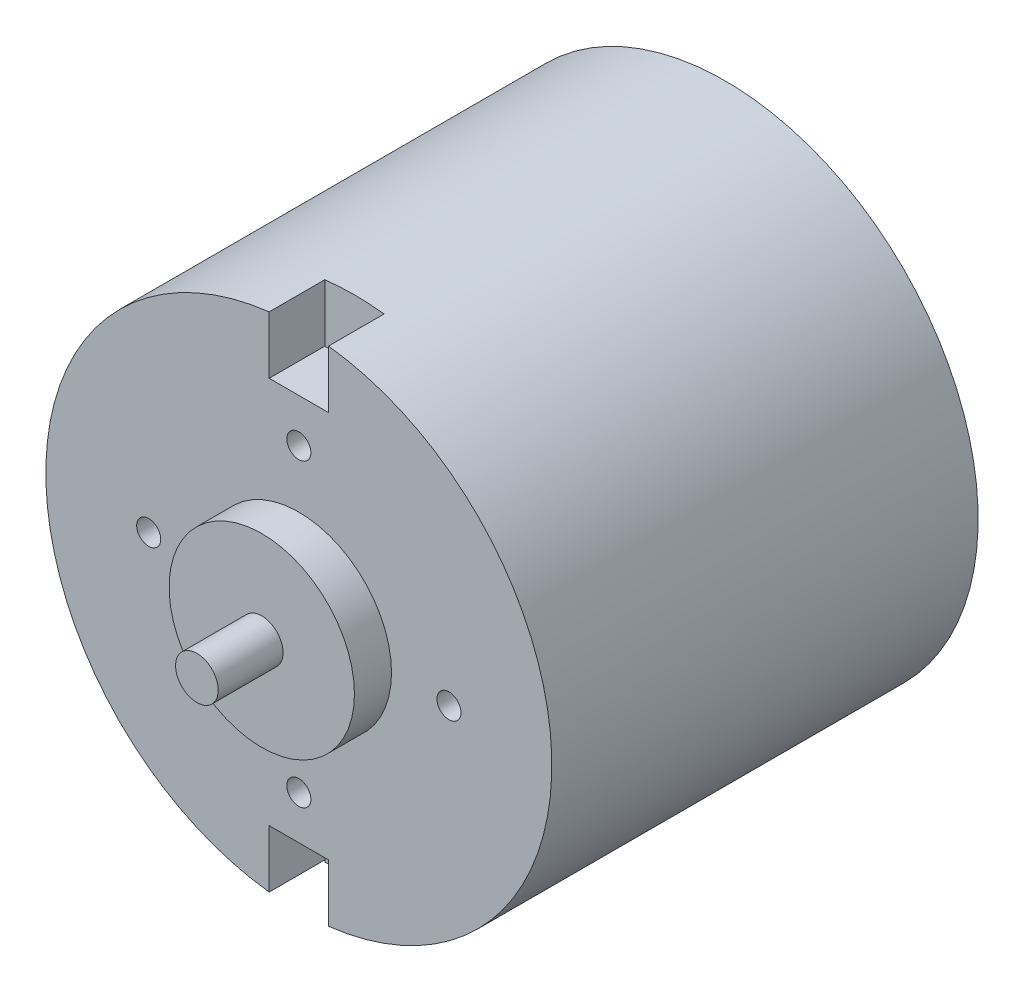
from build123d import *

# Parameters (mm, degrees)
SKETCH1_R           = 0.65
SKETCH1_R_2         = 5
SKETCH1_R_3         = 1.15
BOSS_EXTRUDE1_DEPTH = 3
BOSS_EXTRUDE2_START = -20
BOSS_EXTRUDE2_DEPTH = 20
SKETCH1_4_R         = 5
SKETCH1_4_R_2       = 1.15
BOSS_EXTRUDE3_DEPTH = 5
SKETCH1_5_R         = 1.15
BOSS_EXTRUDE4_DEPTH = 8.5


with BuildPart() as part:
    # Sketch1 → Boss-Extrude1 (new body)
    # profile 1 of 3: a face of its own
    with BuildSketch(Plane.XY):
        with BuildLine():
            Line((-1.6, 10.45), (-1.6, 13.555902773))
            ThreePointArc((-1.6, 13.555902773), (-13.65, 0), (-1.6, -13.555902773))
            Line((-1.6, -13.555902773), (-1.6, -10.45))
            Line((-1.6, -10.45), (1.6, -10.45))
            Line((1.6, -10.45), (1.6, -13.555902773))
            ThreePointArc((1.6, -13.555902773), (10.202021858, -9.068696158), (13.65, 0))
            ThreePointArc((13.65, 0), (10.202021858, 9.068696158), (1.6, 13.555902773))
            Line((1.6, 13.555902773), (1.6, 10.45))
            Line((1.6, 10.45), (-1.6, 10.45))
        make_face()
        with Locations((0, -8.1)):
            Circle(SKETCH1_R, mode=Mode.SUBTRACT)
        with Locations((-8.1, 0)):
            Circle(SKETCH1_R, mode=Mode.SUBTRACT)
        Circle(SKETCH1_R_2, mode=Mode.SUBTRACT)
        with Locations((8.1, 0)):
            Circle(SKETCH1_R, mode=Mode.SUBTRACT)
        with Locations((0, 8.1)):
            Circle(SKETCH1_R, mode=Mode.SUBTRACT)
    # profile 2 of 3: a face of its own
    with BuildSketch(Plane.XY):
        Circle(SKETCH1_R_2)
        Circle(SKETCH1_R_3, mode=Mode.SUBTRACT)
    # profile 3 of 3: a face of its own
    with BuildSketch(Plane.XY):
        Circle(SKETCH1_R_3)
    extrude(amount=BOSS_EXTRUDE1_DEPTH)

    # Sketch1_3 → Boss-Extrude2 (add)
    with BuildSketch(Plane.XY.offset(BOSS_EXTRUDE2_START)):
        with BuildLine():
            Line((-1.6, -13.555902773), (-1.6, -13.65))
            Line((-1.6, -13.65), (1.6, -13.65))
            Line((1.6, -13.65), (1.6, -13.555902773))
            ThreePointArc((1.6, -13.555902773), (0, 13.65), (-1.6, -13.555902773))
        make_face()
    extrude(amount=BOSS_EXTRUDE2_DEPTH)

    # Sketch1_4 → Boss-Extrude3 (add)
    with BuildSketch(Plane.XY):
        Circle(SKETCH1_4_R)
        Circle(SKETCH1_4_R_2, mode=Mode.SUBTRACT)
    extrude(amount=BOSS_EXTRUDE3_DEPTH)

    # Sketch1_5 → Boss-Extrude4 (add)
    with BuildSketch(Plane.XY):
        Circle(SKETCH1_5_R)
    extrude(amount=BOSS_EXTRUDE4_DEPTH)


solid = part.part
